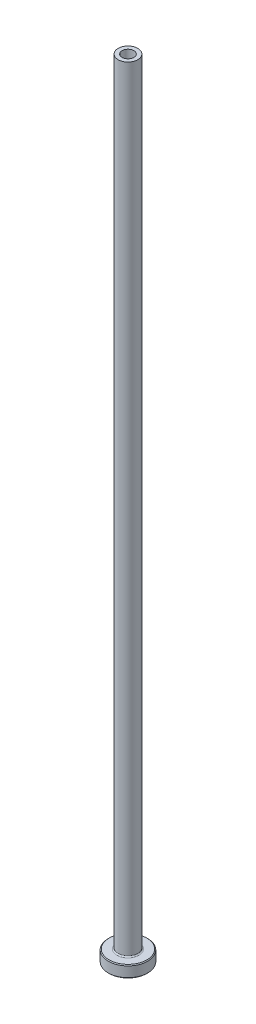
ISO-10303-21;
HEADER;
FILE_DESCRIPTION(('STEP AP214'),'2;1');
FILE_NAME('part.step','',(''),(''),'','','');
FILE_SCHEMA(('AUTOMOTIVE_DESIGN { 1 0 10303 214 1 1 1 1 }'));
ENDSEC;
DATA;
#1=APPLICATION_CONTEXT('core data for automotive mechanical design processes');
#2=APPLICATION_PROTOCOL_DEFINITION('international standard','automotive_design',2000,#1);
#3=PRODUCT_CONTEXT('',#1,'mechanical');
#4=PRODUCT('Part','Part','',(#3));
#5=PRODUCT_RELATED_PRODUCT_CATEGORY('part','',(#4));
#6=PRODUCT_DEFINITION_FORMATION('','',#4);
#7=PRODUCT_DEFINITION_CONTEXT('part definition',#1,'design');
#8=PRODUCT_DEFINITION('design','',#6,#7);
#9=PRODUCT_DEFINITION_SHAPE('','',#8);
#10=(LENGTH_UNIT() NAMED_UNIT(*) SI_UNIT(.MILLI.,.METRE.));
#11=(NAMED_UNIT(*) PLANE_ANGLE_UNIT() SI_UNIT($,.RADIAN.));
#12=(NAMED_UNIT(*) SI_UNIT($,.STERADIAN.) SOLID_ANGLE_UNIT());
#13=UNCERTAINTY_MEASURE_WITH_UNIT(LENGTH_MEASURE(1.E-05),#10,'distance_accuracy_value','');
#14=(GEOMETRIC_REPRESENTATION_CONTEXT(3) GLOBAL_UNCERTAINTY_ASSIGNED_CONTEXT((#13)) GLOBAL_UNIT_ASSIGNED_CONTEXT((#10,
#11,#12)) REPRESENTATION_CONTEXT('',''));
#15=CARTESIAN_POINT('',(0.,0.,0.));
#16=DIRECTION('',(0.,0.,1.));
#17=DIRECTION('',(1.,0.,0.));
#18=AXIS2_PLACEMENT_3D('',#15,#16,#17);
#19=CARTESIAN_POINT('',(0.,92.1876809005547,0.));
#20=DIRECTION('',(0.,1.,0.));
#21=DIRECTION('',(0.,0.,1.));
#22=AXIS2_PLACEMENT_3D('',#19,#20,#21);
#23=CYLINDRICAL_SURFACE('',#22,1.5);
#24=CARTESIAN_POINT('',(0.,200.,0.));
#25=DIRECTION('',(0.,1.,0.));
#26=DIRECTION('',(0.,0.,1.));
#27=AXIS2_PLACEMENT_3D('',#24,#25,#26);
#28=CIRCLE('',#27,1.5);
#29=CARTESIAN_POINT('',(0.,200.,1.5));
#30=VERTEX_POINT('',#29);
#31=EDGE_CURVE('E62',#30,#30,#28,.T.);
#32=ORIENTED_EDGE('',*,*,#31,.T.);
#33=EDGE_LOOP('',(#32));
#34=FACE_BOUND('',#33,.T.);
#35=CARTESIAN_POINT('',(0.,155.,0.));
#36=DIRECTION('',(0.,1.,0.));
#37=DIRECTION('',(0.,0.,1.));
#38=AXIS2_PLACEMENT_3D('',#35,#36,#37);
#39=CIRCLE('',#38,1.5);
#40=CARTESIAN_POINT('',(0.,155.,1.5));
#41=VERTEX_POINT('',#40);
#42=EDGE_CURVE('E71',#41,#41,#39,.T.);
#43=ORIENTED_EDGE('',*,*,#42,.F.);
#44=EDGE_LOOP('',(#43));
#45=FACE_BOUND('',#44,.T.);
#46=ADVANCED_FACE('F30',(#34,#45),#23,.F.);
#47=CARTESIAN_POINT('',(-1.5,200.,0.));
#48=DIRECTION('',(0.,1.,0.));
#49=DIRECTION('',(0.,0.,1.));
#50=AXIS2_PLACEMENT_3D('',#47,#48,#49);
#51=PLANE('',#50);
#52=CARTESIAN_POINT('',(0.,200.,0.));
#53=DIRECTION('',(0.,1.,0.));
#54=DIRECTION('',(0.,0.,1.));
#55=AXIS2_PLACEMENT_3D('',#52,#53,#54);
#56=CIRCLE('',#55,2.50000000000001);
#57=CARTESIAN_POINT('',(0.,200.,2.50000000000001));
#58=VERTEX_POINT('',#57);
#59=EDGE_CURVE('E65',#58,#58,#56,.T.);
#60=ORIENTED_EDGE('',*,*,#59,.T.);
#61=EDGE_LOOP('',(#60));
#62=FACE_BOUND('',#61,.T.);
#63=ORIENTED_EDGE('',*,*,#31,.F.);
#64=EDGE_LOOP('',(#63));
#65=FACE_BOUND('',#64,.T.);
#66=ADVANCED_FACE('F79',(#62,#65),#51,.T.);
#67=CARTESIAN_POINT('',(0.,92.1876809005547,0.));
#68=DIRECTION('',(0.,1.,0.));
#69=DIRECTION('',(0.,0.,1.));
#70=AXIS2_PLACEMENT_3D('',#67,#68,#69);
#71=CYLINDRICAL_SURFACE('',#70,2.5);
#72=CARTESIAN_POINT('',(0.,3.3,0.));
#73=DIRECTION('',(0.,1.,0.));
#74=DIRECTION('',(0.,0.,1.));
#75=AXIS2_PLACEMENT_3D('',#72,#73,#74);
#76=CIRCLE('',#75,2.5);
#77=CARTESIAN_POINT('',(0.,3.3,2.5));
#78=VERTEX_POINT('',#77);
#79=EDGE_CURVE('E59',#78,#78,#76,.T.);
#80=ORIENTED_EDGE('',*,*,#79,.T.);
#81=EDGE_LOOP('',(#80));
#82=FACE_BOUND('',#81,.T.);
#83=ORIENTED_EDGE('',*,*,#59,.F.);
#84=EDGE_LOOP('',(#83));
#85=FACE_BOUND('',#84,.T.);
#86=ADVANCED_FACE('F85',(#82,#85),#71,.T.);
#87=CARTESIAN_POINT('',(-2.49999999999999,3.,0.));
#88=DIRECTION('',(0.,1.,0.));
#89=DIRECTION('',(0.,0.,1.));
#90=AXIS2_PLACEMENT_3D('',#87,#88,#89);
#91=PLANE('',#90);
#92=CARTESIAN_POINT('',(0.,3.,0.));
#93=DIRECTION('',(0.,1.,0.));
#94=DIRECTION('',(0.,0.,1.));
#95=AXIS2_PLACEMENT_3D('',#92,#93,#94);
#96=CIRCLE('',#95,4.79999999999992);
#97=CARTESIAN_POINT('',(0.,3.,4.79999999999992));
#98=VERTEX_POINT('',#97);
#99=EDGE_CURVE('E53',#98,#98,#96,.T.);
#100=ORIENTED_EDGE('',*,*,#99,.T.);
#101=EDGE_LOOP('',(#100));
#102=FACE_BOUND('',#101,.T.);
#103=CARTESIAN_POINT('',(0.,3.,0.));
#104=DIRECTION('',(0.,1.,0.));
#105=DIRECTION('',(0.,0.,1.));
#106=AXIS2_PLACEMENT_3D('',#103,#104,#105);
#107=CIRCLE('',#106,2.8);
#108=CARTESIAN_POINT('',(0.,3.,2.8));
#109=VERTEX_POINT('',#108);
#110=EDGE_CURVE('E56',#109,#109,#107,.F.);
#111=ORIENTED_EDGE('',*,*,#110,.T.);
#112=EDGE_LOOP('',(#111));
#113=FACE_BOUND('',#112,.T.);
#114=ADVANCED_FACE('F111',(#102,#113),#91,.T.);
#115=CARTESIAN_POINT('',(0.,92.1876809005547,0.));
#116=DIRECTION('',(0.,1.,0.));
#117=DIRECTION('',(0.,0.,1.));
#118=AXIS2_PLACEMENT_3D('',#115,#116,#117);
#119=CYLINDRICAL_SURFACE('',#118,4.99999999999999);
#120=CARTESIAN_POINT('',(0.,2.79999999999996,0.));
#121=DIRECTION('',(0.,1.,0.));
#122=DIRECTION('',(0.,0.,1.));
#123=AXIS2_PLACEMENT_3D('',#120,#121,#122);
#124=CIRCLE('',#123,4.99999999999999);
#125=CARTESIAN_POINT('',(0.,2.79999999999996,4.99999999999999));
#126=VERTEX_POINT('',#125);
#127=EDGE_CURVE('E45',#126,#126,#124,.F.);
#128=ORIENTED_EDGE('',*,*,#127,.T.);
#129=EDGE_LOOP('',(#128));
#130=FACE_BOUND('',#129,.T.);
#131=CARTESIAN_POINT('',(0.,0.199999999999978,0.));
#132=DIRECTION('',(0.,-1.,0.));
#133=DIRECTION('',(0.,0.,-1.));
#134=AXIS2_PLACEMENT_3D('',#131,#132,#133);
#135=CIRCLE('',#134,4.99999999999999);
#136=CARTESIAN_POINT('',(0.,0.199999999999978,4.99999999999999));
#137=VERTEX_POINT('',#136);
#138=EDGE_CURVE('E50',#137,#137,#135,.F.);
#139=ORIENTED_EDGE('',*,*,#138,.T.);
#140=EDGE_LOOP('',(#139));
#141=FACE_BOUND('',#140,.T.);
#142=ADVANCED_FACE('F108',(#130,#141),#119,.T.);
#143=CARTESIAN_POINT('',(-4.99999999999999,0.,0.));
#144=DIRECTION('',(0.,-1.,0.));
#145=DIRECTION('',(0.,0.,-1.));
#146=AXIS2_PLACEMENT_3D('',#143,#144,#145);
#147=PLANE('',#146);
#148=CARTESIAN_POINT('',(0.,0.,0.));
#149=DIRECTION('',(0.,-1.,0.));
#150=DIRECTION('',(0.,0.,-1.));
#151=AXIS2_PLACEMENT_3D('',#148,#149,#150);
#152=CIRCLE('',#151,2.25000000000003);
#153=CARTESIAN_POINT('',(0.,0.,-2.25000000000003));
#154=VERTEX_POINT('',#153);
#155=EDGE_CURVE('E37',#154,#154,#152,.F.);
#156=ORIENTED_EDGE('',*,*,#155,.T.);
#157=EDGE_LOOP('',(#156));
#158=FACE_BOUND('',#157,.T.);
#159=CARTESIAN_POINT('',(0.,0.,0.));
#160=DIRECTION('',(0.,-1.,0.));
#161=DIRECTION('',(0.,0.,-1.));
#162=AXIS2_PLACEMENT_3D('',#159,#160,#161);
#163=CIRCLE('',#162,4.80000000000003);
#164=CARTESIAN_POINT('',(0.,0.,4.80000000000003));
#165=VERTEX_POINT('',#164);
#166=EDGE_CURVE('E41',#165,#165,#163,.T.);
#167=ORIENTED_EDGE('',*,*,#166,.T.);
#168=EDGE_LOOP('',(#167));
#169=FACE_BOUND('',#168,.T.);
#170=ADVANCED_FACE('F110',(#158,#169),#147,.T.);
#171=CARTESIAN_POINT('',(0.,92.1876809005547,0.));
#172=DIRECTION('',(0.,1.,0.));
#173=DIRECTION('',(0.,0.,1.));
#174=AXIS2_PLACEMENT_3D('',#171,#172,#173);
#175=CYLINDRICAL_SURFACE('',#174,1.75);
#176=CARTESIAN_POINT('',(0.,0.500000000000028,0.));
#177=DIRECTION('',(0.,-1.,0.));
#178=DIRECTION('',(0.,0.,-1.));
#179=AXIS2_PLACEMENT_3D('',#176,#177,#178);
#180=CIRCLE('',#179,1.75);
#181=CARTESIAN_POINT('',(0.,0.500000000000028,-1.75));
#182=VERTEX_POINT('',#181);
#183=EDGE_CURVE('E10',#182,#182,#180,.T.);
#184=ORIENTED_EDGE('',*,*,#183,.T.);
#185=EDGE_LOOP('',(#184));
#186=FACE_BOUND('',#185,.T.);
#187=CARTESIAN_POINT('',(0.,143.,0.));
#188=DIRECTION('',(0.,1.,0.));
#189=DIRECTION('',(0.,0.,1.));
#190=AXIS2_PLACEMENT_3D('',#187,#188,#189);
#191=CIRCLE('',#190,1.75000000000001);
#192=CARTESIAN_POINT('',(0.,143.,1.75000000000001));
#193=VERTEX_POINT('',#192);
#194=EDGE_CURVE('E68',#193,#193,#191,.T.);
#195=ORIENTED_EDGE('',*,*,#194,.T.);
#196=EDGE_LOOP('',(#195));
#197=FACE_BOUND('',#196,.T.);
#198=ADVANCED_FACE('F118',(#186,#197),#175,.F.);
#199=CARTESIAN_POINT('',(0.,143.,0.));
#200=DIRECTION('',(0.,-1.,0.));
#201=DIRECTION('',(0.,0.,-1.));
#202=AXIS2_PLACEMENT_3D('',#199,#200,#201);
#203=CONICAL_SURFACE('',#202,1.75000000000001,0.0208303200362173);
#204=ORIENTED_EDGE('',*,*,#42,.T.);
#205=EDGE_LOOP('',(#204));
#206=FACE_BOUND('',#205,.T.);
#207=ORIENTED_EDGE('',*,*,#194,.F.);
#208=EDGE_LOOP('',(#207));
#209=FACE_BOUND('',#208,.T.);
#210=ADVANCED_FACE('F75',(#206,#209),#203,.F.);
#211=CARTESIAN_POINT('',(0.,3.3,0.));
#212=DIRECTION('',(0.,1.,0.));
#213=DIRECTION('',(0.,0.,1.));
#214=AXIS2_PLACEMENT_3D('',#211,#212,#213);
#215=TOROIDAL_SURFACE('',#214,2.8,0.3);
#216=ORIENTED_EDGE('',*,*,#110,.F.);
#217=EDGE_LOOP('',(#216));
#218=FACE_BOUND('',#217,.T.);
#219=ORIENTED_EDGE('',*,*,#79,.F.);
#220=EDGE_LOOP('',(#219));
#221=FACE_BOUND('',#220,.T.);
#222=ADVANCED_FACE('F90',(#218,#221),#215,.F.);
#223=CARTESIAN_POINT('',(0.,3.,0.));
#224=DIRECTION('',(0.,-1.,0.));
#225=DIRECTION('',(0.,0.,-1.));
#226=AXIS2_PLACEMENT_3D('',#223,#224,#225);
#227=CONICAL_SURFACE('',#226,4.79999999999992,0.785398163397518);
#228=ORIENTED_EDGE('',*,*,#127,.F.);
#229=EDGE_LOOP('',(#228));
#230=FACE_BOUND('',#229,.T.);
#231=ORIENTED_EDGE('',*,*,#99,.F.);
#232=EDGE_LOOP('',(#231));
#233=FACE_BOUND('',#232,.T.);
#234=ADVANCED_FACE('F93',(#230,#233),#227,.T.);
#235=CARTESIAN_POINT('',(0.,0.199999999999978,0.));
#236=DIRECTION('',(0.,1.,0.));
#237=DIRECTION('',(0.,0.,1.));
#238=AXIS2_PLACEMENT_3D('',#235,#236,#237);
#239=CONICAL_SURFACE('',#238,4.99999999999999,0.785398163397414);
#240=CARTESIAN_POINT('',(0.,0.,4.80000000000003));
#241=CARTESIAN_POINT('',(0.,0.00208333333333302,4.80208333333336));
#242=CARTESIAN_POINT('',(0.,0.00416666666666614,4.80416666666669));
#243=CARTESIAN_POINT('',(0.,0.00833333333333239,4.80833333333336));
#244=CARTESIAN_POINT('',(0.,0.0104166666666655,4.81041666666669));
#245=CARTESIAN_POINT('',(0.,0.0145833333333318,4.81458333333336));
#246=CARTESIAN_POINT('',(0.,0.0166666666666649,4.81666666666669));
#247=CARTESIAN_POINT('',(0.,0.0208333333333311,4.82083333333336));
#248=CARTESIAN_POINT('',(0.,0.0229166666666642,4.82291666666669));
#249=CARTESIAN_POINT('',(0.,0.0270833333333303,4.82708333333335));
#250=CARTESIAN_POINT('',(0.,0.0291666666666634,4.82916666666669));
#251=CARTESIAN_POINT('',(0.,0.0333333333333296,4.83333333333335));
#252=CARTESIAN_POINT('',(0.,0.0354166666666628,4.83541666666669));
#253=CARTESIAN_POINT('',(0.,0.039583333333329,4.83958333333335));
#254=CARTESIAN_POINT('',(0.,0.0416666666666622,4.84166666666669));
#255=CARTESIAN_POINT('',(0.,0.0458333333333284,4.84583333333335));
#256=CARTESIAN_POINT('',(0.,0.0479166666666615,4.84791666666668));
#257=CARTESIAN_POINT('',(0.,0.0520833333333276,4.85208333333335));
#258=CARTESIAN_POINT('',(0.,0.0541666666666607,4.85416666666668));
#259=CARTESIAN_POINT('',(0.,0.0583333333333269,4.85833333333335));
#260=CARTESIAN_POINT('',(0.,0.06041666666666,4.86041666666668));
#261=CARTESIAN_POINT('',(0.,0.0645833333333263,4.86458333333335));
#262=CARTESIAN_POINT('',(0.,0.0666666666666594,4.86666666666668));
#263=CARTESIAN_POINT('',(0.,0.0708333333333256,4.87083333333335));
#264=CARTESIAN_POINT('',(0.,0.0729166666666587,4.87291666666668));
#265=CARTESIAN_POINT('',(0.,0.0770833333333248,4.87708333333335));
#266=CARTESIAN_POINT('',(0.,0.0791666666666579,4.87916666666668));
#267=CARTESIAN_POINT('',(0.,0.0833333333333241,4.88333333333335));
#268=CARTESIAN_POINT('',(0.,0.0854166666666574,4.88541666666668));
#269=CARTESIAN_POINT('',(0.,0.0895833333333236,4.88958333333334));
#270=CARTESIAN_POINT('',(0.,0.0916666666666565,4.89166666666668));
#271=CARTESIAN_POINT('',(0.,0.0958333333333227,4.89583333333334));
#272=CARTESIAN_POINT('',(0.,0.097916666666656,4.89791666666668));
#273=CARTESIAN_POINT('',(0.,0.102083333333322,4.90208333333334));
#274=CARTESIAN_POINT('',(0.,0.104166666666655,4.90416666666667));
#275=CARTESIAN_POINT('',(0.,0.108333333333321,4.90833333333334));
#276=CARTESIAN_POINT('',(0.,0.110416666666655,4.91041666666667));
#277=CARTESIAN_POINT('',(0.,0.114583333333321,4.91458333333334));
#278=CARTESIAN_POINT('',(0.,0.116666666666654,4.91666666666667));
#279=CARTESIAN_POINT('',(0.,0.12083333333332,4.92083333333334));
#280=CARTESIAN_POINT('',(0.,0.122916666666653,4.92291666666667));
#281=CARTESIAN_POINT('',(0.,0.127083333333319,4.92708333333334));
#282=CARTESIAN_POINT('',(0.,0.129166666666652,4.92916666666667));
#283=CARTESIAN_POINT('',(0.,0.133333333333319,4.93333333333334));
#284=CARTESIAN_POINT('',(0.,0.135416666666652,4.93541666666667));
#285=CARTESIAN_POINT('',(0.,0.139583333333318,4.93958333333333));
#286=CARTESIAN_POINT('',(0.,0.141666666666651,4.94166666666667));
#287=CARTESIAN_POINT('',(0.,0.145833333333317,4.94583333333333));
#288=CARTESIAN_POINT('',(0.,0.14791666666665,4.94791666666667));
#289=CARTESIAN_POINT('',(0.,0.152083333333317,4.95208333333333));
#290=CARTESIAN_POINT('',(0.,0.15416666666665,4.95416666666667));
#291=CARTESIAN_POINT('',(0.,0.158333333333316,4.95833333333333));
#292=CARTESIAN_POINT('',(0.,0.160416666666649,4.96041666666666));
#293=CARTESIAN_POINT('',(0.,0.164583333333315,4.96458333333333));
#294=CARTESIAN_POINT('',(0.,0.166666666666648,4.96666666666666));
#295=CARTESIAN_POINT('',(0.,0.170833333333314,4.97083333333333));
#296=CARTESIAN_POINT('',(0.,0.172916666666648,4.97291666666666));
#297=CARTESIAN_POINT('',(0.,0.177083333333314,4.97708333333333));
#298=CARTESIAN_POINT('',(0.,0.179166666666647,4.97916666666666));
#299=CARTESIAN_POINT('',(0.,0.183333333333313,4.98333333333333));
#300=CARTESIAN_POINT('',(0.,0.185416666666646,4.98541666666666));
#301=CARTESIAN_POINT('',(0.,0.189583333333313,4.98958333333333));
#302=CARTESIAN_POINT('',(0.,0.191666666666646,4.99166666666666));
#303=CARTESIAN_POINT('',(0.,0.195833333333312,4.99583333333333));
#304=CARTESIAN_POINT('',(0.,0.197916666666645,4.99791666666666));
#305=CARTESIAN_POINT('',(0.,0.199999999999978,4.99999999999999));
#306=B_SPLINE_CURVE_WITH_KNOTS('',3,(#240,#241,#242,#243,#244,#245,#246,#247,#248,#249,#250,
#251,#252,#253,#254,#255,#256,#257,#258,#259,#260,#261,#262,#263,#264,#265,#266,#267,#268,#269,
#270,#271,#272,#273,#274,#275,#276,#277,#278,#279,#280,#281,#282,#283,#284,#285,#286,#287,#288,
#289,#290,#291,#292,#293,#294,#295,#296,#297,#298,#299,#300,#301,#302,#303,#304,#305),
.UNSPECIFIED.,.F.,.F.,(4,2,2,2,2,2,2,2,2,2,2,2,2,2,2,2,2,2,2,2,2,2,2,2,2,2,2,2,2,2,2,2,4),(0.,
0.00883883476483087,0.0176776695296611,0.0265165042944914,0.0353553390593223,0.0441941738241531,
0.0530330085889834,0.0618718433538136,0.0707106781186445,0.0795495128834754,0.0883883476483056,
0.0972271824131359,0.106066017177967,0.114904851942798,0.123743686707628,0.132582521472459,
0.141421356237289,0.15026019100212,0.15909902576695,0.167937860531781,0.176776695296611,
0.185615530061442,0.194454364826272,0.203293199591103,0.212132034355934,0.220970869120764,
0.229809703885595,0.238648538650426,0.247487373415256,0.256326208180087,0.265165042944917,
0.274003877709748,0.282842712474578),.UNSPECIFIED.);
#307=EDGE_CURVE('BSEAM96',#165,#137,#306,.T.);
#308=ORIENTED_EDGE('',*,*,#166,.F.);
#309=ORIENTED_EDGE('',*,*,#138,.F.);
#310=ORIENTED_EDGE('',*,*,#307,.T.);
#311=ORIENTED_EDGE('',*,*,#307,.F.);
#312=EDGE_LOOP('',(#308,#310,#309,#311));
#313=FACE_BOUND('',#312,.T.);
#314=ADVANCED_FACE('F96',(#313),#239,.T.);
#315=CARTESIAN_POINT('',(0.,0.,0.));
#316=DIRECTION('',(0.,-1.,0.));
#317=DIRECTION('',(0.,0.,-1.));
#318=AXIS2_PLACEMENT_3D('',#315,#316,#317);
#319=CONICAL_SURFACE('',#318,2.25000000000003,0.785398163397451);
#320=ORIENTED_EDGE('',*,*,#183,.F.);
#321=EDGE_LOOP('',(#320));
#322=FACE_BOUND('',#321,.T.);
#323=ORIENTED_EDGE('',*,*,#155,.F.);
#324=EDGE_LOOP('',(#323));
#325=FACE_BOUND('',#324,.T.);
#326=ADVANCED_FACE('F32',(#322,#325),#319,.F.);
#327=CLOSED_SHELL('',(#46,#66,#86,#114,#142,#170,#198,#210,#222,#234,#314,#326));
#328=MANIFOLD_SOLID_BREP('B2',#327);
#329=ADVANCED_BREP_SHAPE_REPRESENTATION('',(#18,#328),#14);
#330=SHAPE_DEFINITION_REPRESENTATION(#9,#329);
ENDSEC;
END-ISO-10303-21;
